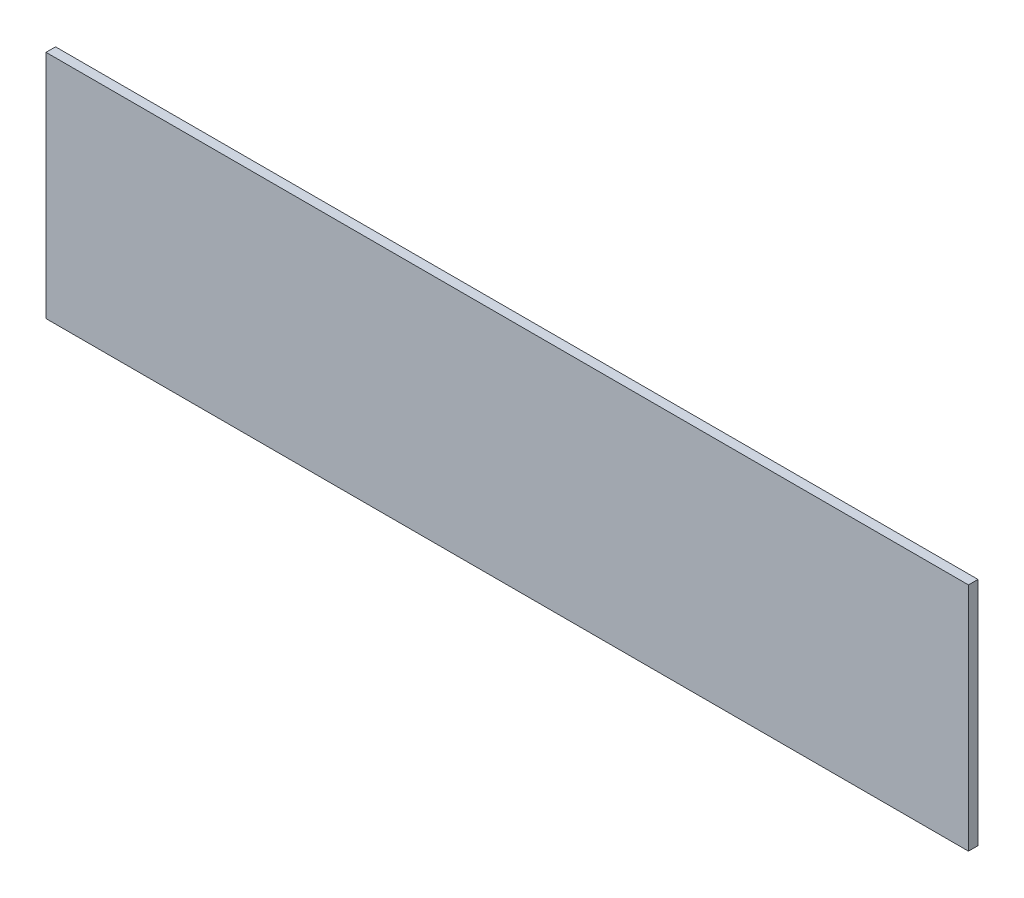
from build123d import *

# Parameters (mm, degrees)
SKETCH1_W           = 968
SKETCH1_H           = 242
BOSS_EXTRUDE1_DEPTH = 10


with BuildPart() as part:
    # Sketch1 → Boss-Extrude1 (new body)
    with BuildSketch(Plane.XY):
        with Locations((484, 121)):
            Rectangle(SKETCH1_W, SKETCH1_H)
    extrude(amount=BOSS_EXTRUDE1_DEPTH)


solid = part.part
